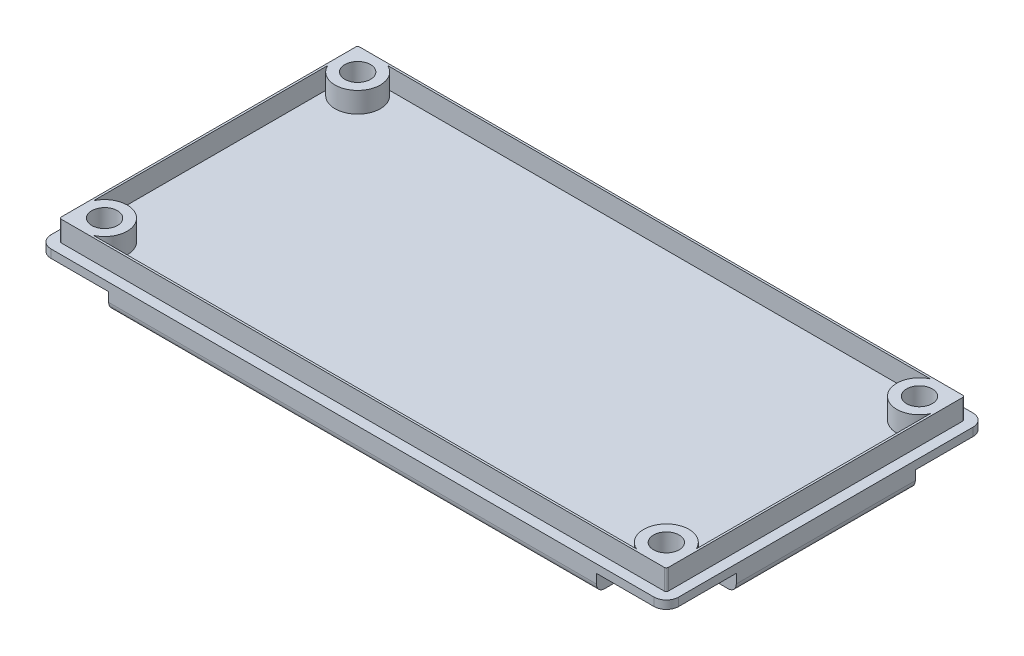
from build123d import *

# Parameters (mm, degrees)
SKETCH1_R            = 0.79375
EXTRUDE1_DEPTH       = 1.5875
FILLET2_R            = 0.508
SKETCH2_R            = 0.79375
EXTRUDE2_DEPTH       = 1.27
CUT_EXTRUDE1_DEPTH   = 1.0795
MIRROR2_COPY_1_DEPTH = 1.0795


with BuildPart() as part:
    # Sketch1 → Extrude1 (new body)
    with BuildSketch(Plane(origin=(0, 0, 0), x_dir=(1, 0, 0), z_dir=(0, 1, 0))):
        with BuildLine():
            Line((-18.6055, 9.8425), (18.6055, 9.8425))
            ThreePointArc((18.6055, 9.8425), (19.144315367, 9.619315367), (19.3675, 9.0805))
            Line((19.3675, 9.0805), (19.3675, -9.0805))
            ThreePointArc((19.3675, -9.0805), (19.144315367, -9.619315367), (18.6055, -9.8425))
            Line((18.6055, -9.8425), (-18.6055, -9.8425))
            ThreePointArc((-18.6055, -9.8425), (-19.144315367, -9.619315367), (-19.3675, -9.0805))
            Line((-19.3675, -9.0805), (-19.3675, 9.0805))
            ThreePointArc((-19.3675, 9.0805), (-19.144315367, 9.619315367), (-18.6055, 9.8425))
        make_face()
        with Locations(Location((-17.3355, 7.8105, 0), (0, 0, 270))):
            Circle(SKETCH1_R, mode=Mode.SUBTRACT)
        with Locations(Location((17.3355, 7.8105, 0), (0, 0, 270))):
            Circle(SKETCH1_R, mode=Mode.SUBTRACT)
        with Locations(Location((17.3355, -7.8105, 0), (0, 0, 270))):
            Circle(SKETCH1_R, mode=Mode.SUBTRACT)
        with Locations(Location((-17.3355, -7.8105, 0), (0, 0, 270))):
            Circle(SKETCH1_R, mode=Mode.SUBTRACT)
    extrude(amount=EXTRUDE1_DEPTH)

    # Fillet2
    fillet2_edges = [part.edges().sort_by_distance(p)[0] for p in [
        (-19.3675, 0, 0),
        (-19.144315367, 0, -9.619315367),
        (0, 0, -9.8425),
        (19.144315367, 0, -9.619315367),
        (19.3675, 0, 0),
        (19.144315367, 0, 9.619315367),
        (0, 0, 9.8425),
        (-19.144315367, 0, 9.619315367),
    ]]
    fillet(fillet2_edges, radius=FILLET2_R)

    # Sketch2 → Extrude2 (add)
    with BuildSketch(Plane(origin=(0, 1.5875, 0), x_dir=(-1, 0, 0), z_dir=(0, 1, 0))):
        with BuildLine():
            Line((18.6055, 9.2075), (-18.6055, 9.2075))
            ThreePointArc((-18.6055, 9.2075), (-18.695302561, 9.170302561), (-18.7325, 9.0805))
            Line((-18.7325, 9.0805), (-18.7325, -9.0805))
            ThreePointArc((-18.7325, -9.0805), (-18.695302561, -9.170302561), (-18.6055, -9.2075))
            Line((-18.6055, -9.2075), (18.6055, -9.2075))
            ThreePointArc((18.6055, -9.2075), (18.695302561, -9.170302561), (18.7325, -9.0805))
            Line((18.7325, -9.0805), (18.7325, 9.0805))
            ThreePointArc((18.7325, 9.0805), (18.695302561, 9.170302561), (18.6055, 9.2075))
        make_face()
        with Locations(Location((-17.3355, 7.8105, 0), (0, 0, 90))):
            Circle(SKETCH2_R, mode=Mode.SUBTRACT)
        with Locations(Location((-17.3355, -7.8105, 0), (0, 0, 90))):
            Circle(SKETCH2_R, mode=Mode.SUBTRACT)
        with Locations(Location((17.3355, -7.8105, 0), (0, 0, 90))):
            Circle(SKETCH2_R, mode=Mode.SUBTRACT)
        with Locations(Location((17.3355, 7.8105, 0), (0, 0, 90))):
            Circle(SKETCH2_R, mode=Mode.SUBTRACT)
        with BuildLine():
            Line((-18.6055, -7.228512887), (-18.6055, 7.228512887))
            ThreePointArc((-18.6055, 7.228512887), (-16.347671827, 6.822671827), (-16.753512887, 9.0805))
            Line((-16.753512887, 9.0805), (16.753512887, 9.0805))
            ThreePointArc((16.753512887, 9.0805), (16.347671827, 6.822671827), (18.6055, 7.228512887))
            Line((18.6055, 7.228512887), (18.6055, -7.228512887))
            ThreePointArc((18.6055, -7.228512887), (16.347671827, -6.822671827), (16.753512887, -9.0805))
            Line((16.753512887, -9.0805), (-16.753512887, -9.0805))
            ThreePointArc((-16.753512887, -9.0805), (-16.347671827, -6.822671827), (-18.6055, -7.228512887))
        make_face(mode=Mode.SUBTRACT)
    extrude(amount=EXTRUDE2_DEPTH)

    # Sketch3 → Cut-Extrude1 (cut)
    with BuildSketch(Plane.XZ):
        with BuildLine():
            Line((-16.3195, -5.5245), (-19.3675, -5.5245))
            Line((-19.3675, -5.5245), (-19.3675, -9.8425))
            Line((-19.3675, -9.8425), (-15.0495, -9.8425))
            Line((-15.0495, -9.8425), (-15.0495, -6.7945))
            ThreePointArc((-15.0495, -6.7945), (-15.421474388, -5.896474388), (-16.3195, -5.5245))
        make_face()
    cut_extrude1 = extrude(amount=-CUT_EXTRUDE1_DEPTH, mode=Mode.SUBTRACT)

    # Mirror1: Cut-Extrude1 across plane
    add(cut_extrude1.mirror(Plane(origin=(0, 0, 0), x_dir=(0, 0, 1), z_dir=(1, 0, 0))), mode=Mode.SUBTRACT)

    # Mirror2: Cut-Extrude1 across plane
    add(cut_extrude1.mirror(Plane.XY), mode=Mode.SUBTRACT)

    # Mirror2 copy 1 sketch → Mirror2 copy 1 (cut)
    with BuildSketch(Plane(origin=(0, 0, 0), x_dir=(-1, 0, 0), z_dir=(0, -1, 0))):
        with BuildLine():
            Line((-16.3195, -5.5245), (-19.3675, -5.5245))
            Line((-19.3675, -5.5245), (-19.3675, -9.8425))
            Line((-19.3675, -9.8425), (-15.0495, -9.8425))
            Line((-15.0495, -9.8425), (-15.0495, -6.7945))
            ThreePointArc((-15.0495, -6.7945), (-15.421474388, -5.896474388), (-16.3195, -5.5245))
        make_face()
    extrude(amount=-MIRROR2_COPY_1_DEPTH, mode=Mode.SUBTRACT)


solid = part.part
